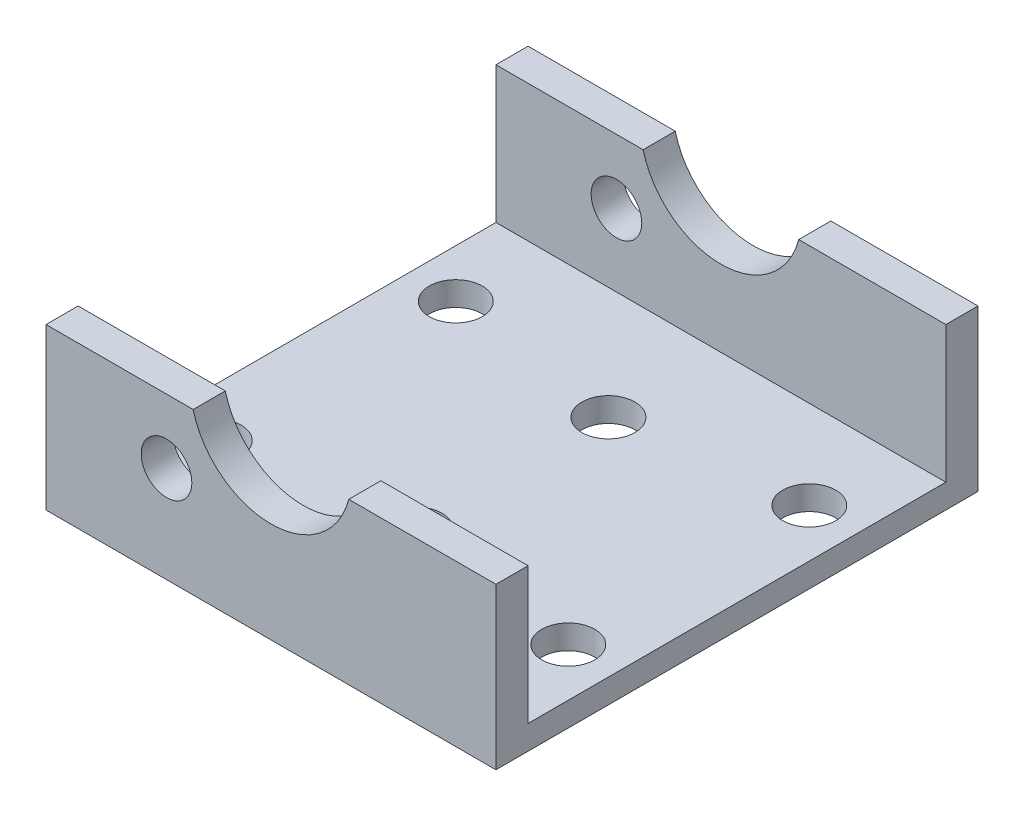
ISO-10303-21;
HEADER;
FILE_DESCRIPTION(('STEP AP214'),'2;1');
FILE_NAME('part.step','',(''),(''),'','','');
FILE_SCHEMA(('AUTOMOTIVE_DESIGN { 1 0 10303 214 1 1 1 1 }'));
ENDSEC;
DATA;
#1=APPLICATION_CONTEXT('core data for automotive mechanical design processes');
#2=APPLICATION_PROTOCOL_DEFINITION('international standard','automotive_design',2000,#1);
#3=PRODUCT_CONTEXT('',#1,'mechanical');
#4=PRODUCT('Part','Part','',(#3));
#5=PRODUCT_RELATED_PRODUCT_CATEGORY('part','',(#4));
#6=PRODUCT_DEFINITION_FORMATION('','',#4);
#7=PRODUCT_DEFINITION_CONTEXT('part definition',#1,'design');
#8=PRODUCT_DEFINITION('design','',#6,#7);
#9=PRODUCT_DEFINITION_SHAPE('','',#8);
#10=(LENGTH_UNIT() NAMED_UNIT(*) SI_UNIT(.MILLI.,.METRE.));
#11=(NAMED_UNIT(*) PLANE_ANGLE_UNIT() SI_UNIT($,.RADIAN.));
#12=(NAMED_UNIT(*) SI_UNIT($,.STERADIAN.) SOLID_ANGLE_UNIT());
#13=UNCERTAINTY_MEASURE_WITH_UNIT(LENGTH_MEASURE(1.E-05),#10,'distance_accuracy_value','');
#14=(GEOMETRIC_REPRESENTATION_CONTEXT(3) GLOBAL_UNCERTAINTY_ASSIGNED_CONTEXT((#13)) GLOBAL_UNIT_ASSIGNED_CONTEXT((#10,
#11,#12)) REPRESENTATION_CONTEXT('',''));
#15=CARTESIAN_POINT('',(0.,0.,0.));
#16=DIRECTION('',(0.,0.,1.));
#17=DIRECTION('',(1.,0.,0.));
#18=AXIS2_PLACEMENT_3D('',#15,#16,#17);
#19=CARTESIAN_POINT('',(-28.,35.,30.));
#20=DIRECTION('',(0.,-1.,0.));
#21=DIRECTION('',(0.,0.,-1.));
#22=AXIS2_PLACEMENT_3D('',#19,#20,#21);
#23=PLANE('',#22);
#24=DIRECTION('',(0.,0.,-1.));
#25=VECTOR('',#24,1.);
#26=CARTESIAN_POINT('',(28.,35.,30.));
#27=LINE('',#26,#25);
#28=CARTESIAN_POINT('',(28.,35.,30.));
#29=VERTEX_POINT('',#28);
#30=CARTESIAN_POINT('',(28.,35.,26.));
#31=VERTEX_POINT('',#30);
#32=EDGE_CURVE('E142',#29,#31,#27,.T.);
#33=ORIENTED_EDGE('',*,*,#32,.T.);
#34=DIRECTION('',(-1.,0.,0.));
#35=VECTOR('',#34,1.);
#36=CARTESIAN_POINT('',(28.,35.,26.));
#37=LINE('',#36,#35);
#38=CARTESIAN_POINT('',(9.68245836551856,35.,26.));
#39=VERTEX_POINT('',#38);
#40=EDGE_CURVE('E127',#31,#39,#37,.T.);
#41=ORIENTED_EDGE('',*,*,#40,.T.);
#42=DIRECTION('',(0.,0.,1.));
#43=VECTOR('',#42,1.);
#44=CARTESIAN_POINT('',(9.68245836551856,35.,-30.));
#45=LINE('',#44,#43);
#46=CARTESIAN_POINT('',(9.68245836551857,35.,30.));
#47=VERTEX_POINT('',#46);
#48=EDGE_CURVE('E195',#39,#47,#45,.T.);
#49=ORIENTED_EDGE('',*,*,#48,.T.);
#50=DIRECTION('',(-1.,0.,0.));
#51=VECTOR('',#50,1.);
#52=CARTESIAN_POINT('',(-28.,35.,30.));
#53=LINE('',#52,#51);
#54=EDGE_CURVE('E151',#29,#47,#53,.T.);
#55=ORIENTED_EDGE('',*,*,#54,.F.);
#56=EDGE_LOOP('',(#33,#41,#49,#55));
#57=FACE_BOUND('',#56,.T.);
#58=ADVANCED_FACE('F35',(#57),#23,.F.);
#59=DIRECTION('',(0.,0.,1.));
#60=VECTOR('',#59,1.);
#61=CARTESIAN_POINT('',(-9.68245836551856,35.,-30.));
#62=LINE('',#61,#60);
#63=CARTESIAN_POINT('',(-9.68245836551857,35.,30.));
#64=VERTEX_POINT('',#63);
#65=CARTESIAN_POINT('',(-9.68245836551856,35.,26.));
#66=VERTEX_POINT('',#65);
#67=EDGE_CURVE('E192',#64,#66,#62,.F.);
#68=ORIENTED_EDGE('',*,*,#67,.T.);
#69=CARTESIAN_POINT('',(-28.,35.,26.));
#70=VERTEX_POINT('',#69);
#71=EDGE_CURVE('E136',#66,#70,#37,.T.);
#72=ORIENTED_EDGE('',*,*,#71,.T.);
#73=DIRECTION('',(0.,0.,-1.));
#74=VECTOR('',#73,1.);
#75=CARTESIAN_POINT('',(-28.,35.,30.));
#76=LINE('',#75,#74);
#77=CARTESIAN_POINT('',(-28.,35.,30.));
#78=VERTEX_POINT('',#77);
#79=EDGE_CURVE('E158',#78,#70,#76,.T.);
#80=ORIENTED_EDGE('',*,*,#79,.F.);
#81=EDGE_CURVE('E218',#64,#78,#53,.T.);
#82=ORIENTED_EDGE('',*,*,#81,.F.);
#83=EDGE_LOOP('',(#68,#72,#80,#82));
#84=FACE_BOUND('',#83,.T.);
#85=ADVANCED_FACE('F256',(#84),#23,.F.);
#86=CARTESIAN_POINT('',(0.,37.5,-30.));
#87=DIRECTION('',(0.,0.,1.));
#88=DIRECTION('',(1.,0.,0.));
#89=AXIS2_PLACEMENT_3D('',#86,#87,#88);
#90=CYLINDRICAL_SURFACE('',#89,10.);
#91=ORIENTED_EDGE('',*,*,#48,.F.);
#92=CARTESIAN_POINT('',(0.,37.5,26.));
#93=DIRECTION('',(0.,0.,1.));
#94=DIRECTION('',(1.,0.,0.));
#95=AXIS2_PLACEMENT_3D('',#92,#93,#94);
#96=CIRCLE('',#95,10.);
#97=EDGE_CURVE('E11',#39,#66,#96,.F.);
#98=ORIENTED_EDGE('',*,*,#97,.T.);
#99=ORIENTED_EDGE('',*,*,#67,.F.);
#100=CARTESIAN_POINT('',(0.,37.5,30.));
#101=DIRECTION('',(0.,0.,1.));
#102=DIRECTION('',(1.,0.,0.));
#103=AXIS2_PLACEMENT_3D('',#100,#101,#102);
#104=CIRCLE('',#103,10.);
#105=EDGE_CURVE('E186',#64,#47,#104,.T.);
#106=ORIENTED_EDGE('',*,*,#105,.T.);
#107=EDGE_LOOP('',(#91,#98,#99,#106));
#108=FACE_BOUND('',#107,.T.);
#109=ADVANCED_FACE('F272',(#108),#90,.F.);
#110=CARTESIAN_POINT('',(9.68245836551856,35.,-30.));
#111=VERTEX_POINT('',#110);
#112=CARTESIAN_POINT('',(9.68245836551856,35.,-26.));
#113=VERTEX_POINT('',#112);
#114=EDGE_CURVE('E59',#111,#113,#45,.T.);
#115=ORIENTED_EDGE('',*,*,#114,.T.);
#116=DIRECTION('',(-1.,0.,0.));
#117=VECTOR('',#116,1.);
#118=CARTESIAN_POINT('',(28.,35.,-26.));
#119=LINE('',#118,#117);
#120=CARTESIAN_POINT('',(28.,35.,-26.));
#121=VERTEX_POINT('',#120);
#122=EDGE_CURVE('E52',#121,#113,#119,.T.);
#123=ORIENTED_EDGE('',*,*,#122,.F.);
#124=CARTESIAN_POINT('',(28.,35.,-30.));
#125=VERTEX_POINT('',#124);
#126=EDGE_CURVE('E153',#121,#125,#27,.T.);
#127=ORIENTED_EDGE('',*,*,#126,.T.);
#128=DIRECTION('',(-1.,0.,0.));
#129=VECTOR('',#128,1.);
#130=CARTESIAN_POINT('',(-28.,35.,-30.));
#131=LINE('',#130,#129);
#132=EDGE_CURVE('E214',#125,#111,#131,.T.);
#133=ORIENTED_EDGE('',*,*,#132,.T.);
#134=EDGE_LOOP('',(#115,#123,#127,#133));
#135=FACE_BOUND('',#134,.T.);
#136=ADVANCED_FACE('F266',(#135),#23,.F.);
#137=CARTESIAN_POINT('',(-28.,15.,30.));
#138=DIRECTION('',(1.,0.,0.));
#139=DIRECTION('',(0.,1.,0.));
#140=AXIS2_PLACEMENT_3D('',#137,#138,#139);
#141=PLANE('',#140);
#142=ORIENTED_EDGE('',*,*,#79,.T.);
#143=DIRECTION('',(0.,1.,0.));
#144=VECTOR('',#143,1.);
#145=CARTESIAN_POINT('',(-28.,35.,26.));
#146=LINE('',#145,#144);
#147=CARTESIAN_POINT('',(-28.,18.,26.));
#148=VERTEX_POINT('',#147);
#149=EDGE_CURVE('E252',#148,#70,#146,.T.);
#150=ORIENTED_EDGE('',*,*,#149,.F.);
#151=DIRECTION('',(0.,0.,1.));
#152=VECTOR('',#151,1.);
#153=CARTESIAN_POINT('',(-28.,18.,26.));
#154=LINE('',#153,#152);
#155=CARTESIAN_POINT('',(-28.,18.,-26.));
#156=VERTEX_POINT('',#155);
#157=EDGE_CURVE('E148',#156,#148,#154,.T.);
#158=ORIENTED_EDGE('',*,*,#157,.F.);
#159=DIRECTION('',(0.,-1.,0.));
#160=VECTOR('',#159,1.);
#161=CARTESIAN_POINT('',(-28.,35.,-26.));
#162=LINE('',#161,#160);
#163=CARTESIAN_POINT('',(-28.,35.,-26.));
#164=VERTEX_POINT('',#163);
#165=EDGE_CURVE('E249',#164,#156,#162,.T.);
#166=ORIENTED_EDGE('',*,*,#165,.F.);
#167=CARTESIAN_POINT('',(-28.,35.,-30.));
#168=VERTEX_POINT('',#167);
#169=EDGE_CURVE('E220',#164,#168,#76,.T.);
#170=ORIENTED_EDGE('',*,*,#169,.T.);
#171=DIRECTION('',(0.,-1.,0.));
#172=VECTOR('',#171,1.);
#173=CARTESIAN_POINT('',(-28.,15.,-30.));
#174=LINE('',#173,#172);
#175=CARTESIAN_POINT('',(-28.,15.,-30.));
#176=VERTEX_POINT('',#175);
#177=EDGE_CURVE('E209',#168,#176,#174,.T.);
#178=ORIENTED_EDGE('',*,*,#177,.T.);
#179=DIRECTION('',(0.,0.,-1.));
#180=VECTOR('',#179,1.);
#181=CARTESIAN_POINT('',(-28.,15.,30.));
#182=LINE('',#181,#180);
#183=CARTESIAN_POINT('',(-28.,15.,30.));
#184=VERTEX_POINT('',#183);
#185=EDGE_CURVE('E156',#184,#176,#182,.T.);
#186=ORIENTED_EDGE('',*,*,#185,.F.);
#187=DIRECTION('',(0.,-1.,0.));
#188=VECTOR('',#187,1.);
#189=CARTESIAN_POINT('',(-28.,15.,30.));
#190=LINE('',#189,#188);
#191=EDGE_CURVE('E210',#78,#184,#190,.T.);
#192=ORIENTED_EDGE('',*,*,#191,.F.);
#193=EDGE_LOOP('',(#142,#150,#158,#166,#170,#178,#186,#192));
#194=FACE_BOUND('',#193,.T.);
#195=ADVANCED_FACE('F37',(#194),#141,.F.);
#196=CARTESIAN_POINT('',(-28.,15.,30.));
#197=DIRECTION('',(0.,1.,0.));
#198=DIRECTION('',(0.,0.,1.));
#199=AXIS2_PLACEMENT_3D('',#196,#197,#198);
#200=PLANE('',#199);
#201=CARTESIAN_POINT('',(-1.41900380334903E-13,15.,12.));
#202=DIRECTION('',(0.,1.,0.));
#203=DIRECTION('',(0.,0.,1.));
#204=AXIS2_PLACEMENT_3D('',#201,#202,#203);
#205=CIRCLE('',#204,3.3);
#206=CARTESIAN_POINT('',(-1.41900380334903E-13,15.,15.3));
#207=VERTEX_POINT('',#206);
#208=EDGE_CURVE('E313',#207,#207,#205,.T.);
#209=ORIENTED_EDGE('',*,*,#208,.T.);
#210=EDGE_LOOP('',(#209));
#211=FACE_BOUND('',#210,.T.);
#212=CARTESIAN_POINT('',(-1.41900380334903E-13,15.,-12.));
#213=DIRECTION('',(0.,1.,0.));
#214=DIRECTION('',(0.,0.,1.));
#215=AXIS2_PLACEMENT_3D('',#212,#213,#214);
#216=CIRCLE('',#215,3.3);
#217=CARTESIAN_POINT('',(-1.41900380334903E-13,15.,-8.7));
#218=VERTEX_POINT('',#217);
#219=EDGE_CURVE('E260',#218,#218,#216,.T.);
#220=ORIENTED_EDGE('',*,*,#219,.T.);
#221=EDGE_LOOP('',(#220));
#222=FACE_BOUND('',#221,.T.);
#223=CARTESIAN_POINT('',(-22.0000000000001,15.,15.));
#224=DIRECTION('',(0.,1.,0.));
#225=DIRECTION('',(0.,0.,1.));
#226=AXIS2_PLACEMENT_3D('',#223,#224,#225);
#227=CIRCLE('',#226,3.3);
#228=CARTESIAN_POINT('',(-22.0000000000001,15.,18.3));
#229=VERTEX_POINT('',#228);
#230=EDGE_CURVE('E197',#229,#229,#227,.T.);
#231=ORIENTED_EDGE('',*,*,#230,.T.);
#232=EDGE_LOOP('',(#231));
#233=FACE_BOUND('',#232,.T.);
#234=CARTESIAN_POINT('',(-22.0000000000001,15.,-15.));
#235=DIRECTION('',(0.,1.,0.));
#236=DIRECTION('',(0.,0.,1.));
#237=AXIS2_PLACEMENT_3D('',#234,#235,#236);
#238=CIRCLE('',#237,3.3);
#239=CARTESIAN_POINT('',(-22.0000000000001,15.,-11.7));
#240=VERTEX_POINT('',#239);
#241=EDGE_CURVE('E200',#240,#240,#238,.T.);
#242=ORIENTED_EDGE('',*,*,#241,.T.);
#243=EDGE_LOOP('',(#242));
#244=FACE_BOUND('',#243,.T.);
#245=CARTESIAN_POINT('',(21.9999999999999,15.,-15.));
#246=DIRECTION('',(0.,1.,0.));
#247=DIRECTION('',(0.,0.,1.));
#248=AXIS2_PLACEMENT_3D('',#245,#246,#247);
#249=CIRCLE('',#248,3.3);
#250=CARTESIAN_POINT('',(21.9999999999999,15.,-11.7));
#251=VERTEX_POINT('',#250);
#252=EDGE_CURVE('E203',#251,#251,#249,.T.);
#253=ORIENTED_EDGE('',*,*,#252,.T.);
#254=EDGE_LOOP('',(#253));
#255=FACE_BOUND('',#254,.T.);
#256=CARTESIAN_POINT('',(21.9999999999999,15.,15.));
#257=DIRECTION('',(0.,1.,0.));
#258=DIRECTION('',(0.,0.,1.));
#259=AXIS2_PLACEMENT_3D('',#256,#257,#258);
#260=CIRCLE('',#259,3.3);
#261=CARTESIAN_POINT('',(21.9999999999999,15.,18.3));
#262=VERTEX_POINT('',#261);
#263=EDGE_CURVE('E206',#262,#262,#260,.T.);
#264=ORIENTED_EDGE('',*,*,#263,.T.);
#265=EDGE_LOOP('',(#264));
#266=FACE_BOUND('',#265,.T.);
#267=DIRECTION('',(1.,0.,0.));
#268=VECTOR('',#267,1.);
#269=CARTESIAN_POINT('',(-28.,15.,-30.));
#270=LINE('',#269,#268);
#271=CARTESIAN_POINT('',(28.,15.,-30.));
#272=VERTEX_POINT('',#271);
#273=EDGE_CURVE('E223',#176,#272,#270,.T.);
#274=ORIENTED_EDGE('',*,*,#273,.T.);
#275=DIRECTION('',(0.,0.,-1.));
#276=VECTOR('',#275,1.);
#277=CARTESIAN_POINT('',(28.,15.,30.));
#278=LINE('',#277,#276);
#279=CARTESIAN_POINT('',(28.,15.,30.));
#280=VERTEX_POINT('',#279);
#281=EDGE_CURVE('E152',#280,#272,#278,.T.);
#282=ORIENTED_EDGE('',*,*,#281,.F.);
#283=DIRECTION('',(1.,0.,0.));
#284=VECTOR('',#283,1.);
#285=CARTESIAN_POINT('',(-28.,15.,30.));
#286=LINE('',#285,#284);
#287=EDGE_CURVE('E213',#184,#280,#286,.T.);
#288=ORIENTED_EDGE('',*,*,#287,.F.);
#289=ORIENTED_EDGE('',*,*,#185,.T.);
#290=EDGE_LOOP('',(#274,#282,#288,#289));
#291=FACE_BOUND('',#290,.T.);
#292=ADVANCED_FACE('F299',(#211,#222,#233,#244,#255,#266,#291),#200,.F.);
#293=CARTESIAN_POINT('',(28.,15.,30.));
#294=DIRECTION('',(-1.,0.,0.));
#295=DIRECTION('',(0.,-1.,0.));
#296=AXIS2_PLACEMENT_3D('',#293,#294,#295);
#297=PLANE('',#296);
#298=DIRECTION('',(0.,0.,1.));
#299=VECTOR('',#298,1.);
#300=CARTESIAN_POINT('',(28.,18.,26.));
#301=LINE('',#300,#299);
#302=CARTESIAN_POINT('',(28.,18.,-26.));
#303=VERTEX_POINT('',#302);
#304=CARTESIAN_POINT('',(28.,18.,26.));
#305=VERTEX_POINT('',#304);
#306=EDGE_CURVE('E146',#303,#305,#301,.T.);
#307=ORIENTED_EDGE('',*,*,#306,.T.);
#308=DIRECTION('',(0.,1.,0.));
#309=VECTOR('',#308,1.);
#310=CARTESIAN_POINT('',(28.,35.,26.));
#311=LINE('',#310,#309);
#312=EDGE_CURVE('E130',#305,#31,#311,.T.);
#313=ORIENTED_EDGE('',*,*,#312,.T.);
#314=ORIENTED_EDGE('',*,*,#32,.F.);
#315=DIRECTION('',(0.,1.,0.));
#316=VECTOR('',#315,1.);
#317=CARTESIAN_POINT('',(28.,15.,30.));
#318=LINE('',#317,#316);
#319=EDGE_CURVE('E216',#280,#29,#318,.T.);
#320=ORIENTED_EDGE('',*,*,#319,.F.);
#321=ORIENTED_EDGE('',*,*,#281,.T.);
#322=DIRECTION('',(0.,1.,0.));
#323=VECTOR('',#322,1.);
#324=CARTESIAN_POINT('',(28.,15.,-30.));
#325=LINE('',#324,#323);
#326=EDGE_CURVE('E225',#272,#125,#325,.T.);
#327=ORIENTED_EDGE('',*,*,#326,.T.);
#328=ORIENTED_EDGE('',*,*,#126,.F.);
#329=DIRECTION('',(0.,-1.,0.));
#330=VECTOR('',#329,1.);
#331=CARTESIAN_POINT('',(28.,35.,-26.));
#332=LINE('',#331,#330);
#333=EDGE_CURVE('E147',#121,#303,#332,.T.);
#334=ORIENTED_EDGE('',*,*,#333,.T.);
#335=EDGE_LOOP('',(#307,#313,#314,#320,#321,#327,#328,#334));
#336=FACE_BOUND('',#335,.T.);
#337=ADVANCED_FACE('F140',(#336),#297,.F.);
#338=ORIENTED_EDGE('',*,*,#169,.F.);
#339=CARTESIAN_POINT('',(-9.68245836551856,35.,-26.));
#340=VERTEX_POINT('',#339);
#341=EDGE_CURVE('E135',#340,#164,#119,.T.);
#342=ORIENTED_EDGE('',*,*,#341,.F.);
#343=CARTESIAN_POINT('',(-9.68245836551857,35.,-30.));
#344=VERTEX_POINT('',#343);
#345=EDGE_CURVE('E189',#340,#344,#62,.F.);
#346=ORIENTED_EDGE('',*,*,#345,.T.);
#347=EDGE_CURVE('E227',#344,#168,#131,.T.);
#348=ORIENTED_EDGE('',*,*,#347,.T.);
#349=EDGE_LOOP('',(#338,#342,#346,#348));
#350=FACE_BOUND('',#349,.T.);
#351=ADVANCED_FACE('F236',(#350),#23,.F.);
#352=CARTESIAN_POINT('',(-28.,35.,30.));
#353=DIRECTION('',(0.,0.,-1.));
#354=DIRECTION('',(-1.,0.,0.));
#355=AXIS2_PLACEMENT_3D('',#352,#353,#354);
#356=PLANE('',#355);
#357=CARTESIAN_POINT('',(-13.,27.,30.));
#358=DIRECTION('',(0.,0.,1.));
#359=DIRECTION('',(1.,0.,0.));
#360=AXIS2_PLACEMENT_3D('',#357,#358,#359);
#361=CIRCLE('',#360,3.15000000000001);
#362=CARTESIAN_POINT('',(-9.84999999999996,27.,30.));
#363=VERTEX_POINT('',#362);
#364=EDGE_CURVE('E451',#363,#363,#361,.T.);
#365=ORIENTED_EDGE('',*,*,#364,.F.);
#366=EDGE_LOOP('',(#365));
#367=FACE_BOUND('',#366,.T.);
#368=ORIENTED_EDGE('',*,*,#54,.T.);
#369=ORIENTED_EDGE('',*,*,#105,.F.);
#370=ORIENTED_EDGE('',*,*,#81,.T.);
#371=ORIENTED_EDGE('',*,*,#191,.T.);
#372=ORIENTED_EDGE('',*,*,#287,.T.);
#373=ORIENTED_EDGE('',*,*,#319,.T.);
#374=EDGE_LOOP('',(#368,#369,#370,#371,#372,#373));
#375=FACE_BOUND('',#374,.T.);
#376=ADVANCED_FACE('F292',(#367,#375),#356,.F.);
#377=CARTESIAN_POINT('',(-28.,35.,-30.));
#378=DIRECTION('',(0.,0.,-1.));
#379=DIRECTION('',(-1.,0.,0.));
#380=AXIS2_PLACEMENT_3D('',#377,#378,#379);
#381=PLANE('',#380);
#382=CARTESIAN_POINT('',(-13.,27.,-30.));
#383=DIRECTION('',(0.,0.,1.));
#384=DIRECTION('',(1.,0.,0.));
#385=AXIS2_PLACEMENT_3D('',#382,#383,#384);
#386=CIRCLE('',#385,3.15000000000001);
#387=CARTESIAN_POINT('',(-9.84999999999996,27.,-30.));
#388=VERTEX_POINT('',#387);
#389=EDGE_CURVE('E460',#388,#388,#386,.T.);
#390=ORIENTED_EDGE('',*,*,#389,.T.);
#391=EDGE_LOOP('',(#390));
#392=FACE_BOUND('',#391,.T.);
#393=CARTESIAN_POINT('',(0.,37.5,-30.));
#394=DIRECTION('',(0.,0.,1.));
#395=DIRECTION('',(1.,0.,0.));
#396=AXIS2_PLACEMENT_3D('',#393,#394,#395);
#397=CIRCLE('',#396,10.);
#398=EDGE_CURVE('E187',#344,#111,#397,.T.);
#399=ORIENTED_EDGE('',*,*,#398,.T.);
#400=ORIENTED_EDGE('',*,*,#132,.F.);
#401=ORIENTED_EDGE('',*,*,#326,.F.);
#402=ORIENTED_EDGE('',*,*,#273,.F.);
#403=ORIENTED_EDGE('',*,*,#177,.F.);
#404=ORIENTED_EDGE('',*,*,#347,.F.);
#405=EDGE_LOOP('',(#399,#400,#401,#402,#403,#404));
#406=FACE_BOUND('',#405,.T.);
#407=ADVANCED_FACE('F240',(#392,#406),#381,.T.);
#408=CARTESIAN_POINT('',(21.9999999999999,35.,15.));
#409=DIRECTION('',(0.,1.,0.));
#410=DIRECTION('',(0.,0.,1.));
#411=AXIS2_PLACEMENT_3D('',#408,#409,#410);
#412=CYLINDRICAL_SURFACE('',#411,3.29999999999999);
#413=CARTESIAN_POINT('',(21.9999999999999,18.,15.));
#414=DIRECTION('',(0.,-1.,0.));
#415=DIRECTION('',(1.,0.,0.));
#416=AXIS2_PLACEMENT_3D('',#413,#414,#415);
#417=CIRCLE('',#416,3.29999999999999);
#418=CARTESIAN_POINT('',(25.2999999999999,18.,15.));
#419=VERTEX_POINT('',#418);
#420=EDGE_CURVE('E183',#419,#419,#417,.F.);
#421=ORIENTED_EDGE('',*,*,#420,.T.);
#422=EDGE_LOOP('',(#421));
#423=FACE_BOUND('',#422,.T.);
#424=ORIENTED_EDGE('',*,*,#263,.F.);
#425=EDGE_LOOP('',(#424));
#426=FACE_BOUND('',#425,.T.);
#427=ADVANCED_FACE('F328',(#423,#426),#412,.F.);
#428=CARTESIAN_POINT('',(21.9999999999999,35.,-15.));
#429=DIRECTION('',(0.,1.,0.));
#430=DIRECTION('',(0.,0.,1.));
#431=AXIS2_PLACEMENT_3D('',#428,#429,#430);
#432=CYLINDRICAL_SURFACE('',#431,3.29999999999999);
#433=CARTESIAN_POINT('',(21.9999999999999,18.,-15.));
#434=DIRECTION('',(0.,-1.,0.));
#435=DIRECTION('',(1.,0.,0.));
#436=AXIS2_PLACEMENT_3D('',#433,#434,#435);
#437=CIRCLE('',#436,3.29999999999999);
#438=CARTESIAN_POINT('',(25.2999999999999,18.,-15.));
#439=VERTEX_POINT('',#438);
#440=EDGE_CURVE('E171',#439,#439,#437,.F.);
#441=ORIENTED_EDGE('',*,*,#440,.T.);
#442=EDGE_LOOP('',(#441));
#443=FACE_BOUND('',#442,.T.);
#444=ORIENTED_EDGE('',*,*,#252,.F.);
#445=EDGE_LOOP('',(#444));
#446=FACE_BOUND('',#445,.T.);
#447=ADVANCED_FACE('F330',(#443,#446),#432,.F.);
#448=CARTESIAN_POINT('',(-22.0000000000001,35.,-15.));
#449=DIRECTION('',(0.,1.,0.));
#450=DIRECTION('',(0.,0.,1.));
#451=AXIS2_PLACEMENT_3D('',#448,#449,#450);
#452=CYLINDRICAL_SURFACE('',#451,3.29999999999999);
#453=CARTESIAN_POINT('',(-22.0000000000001,18.,-15.));
#454=DIRECTION('',(0.,-1.,0.));
#455=DIRECTION('',(1.,0.,0.));
#456=AXIS2_PLACEMENT_3D('',#453,#454,#455);
#457=CIRCLE('',#456,3.29999999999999);
#458=CARTESIAN_POINT('',(-18.7000000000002,18.,-15.));
#459=VERTEX_POINT('',#458);
#460=EDGE_CURVE('E166',#459,#459,#457,.F.);
#461=ORIENTED_EDGE('',*,*,#460,.T.);
#462=EDGE_LOOP('',(#461));
#463=FACE_BOUND('',#462,.T.);
#464=ORIENTED_EDGE('',*,*,#241,.F.);
#465=EDGE_LOOP('',(#464));
#466=FACE_BOUND('',#465,.T.);
#467=ADVANCED_FACE('F279',(#463,#466),#452,.F.);
#468=CARTESIAN_POINT('',(-22.0000000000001,35.,15.));
#469=DIRECTION('',(0.,1.,0.));
#470=DIRECTION('',(0.,0.,1.));
#471=AXIS2_PLACEMENT_3D('',#468,#469,#470);
#472=CYLINDRICAL_SURFACE('',#471,3.29999999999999);
#473=CARTESIAN_POINT('',(-22.0000000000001,18.,15.));
#474=DIRECTION('',(0.,-1.,0.));
#475=DIRECTION('',(1.,0.,0.));
#476=AXIS2_PLACEMENT_3D('',#473,#474,#475);
#477=CIRCLE('',#476,3.29999999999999);
#478=CARTESIAN_POINT('',(-18.7000000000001,18.,15.));
#479=VERTEX_POINT('',#478);
#480=EDGE_CURVE('E164',#479,#479,#477,.F.);
#481=ORIENTED_EDGE('',*,*,#480,.T.);
#482=EDGE_LOOP('',(#481));
#483=FACE_BOUND('',#482,.T.);
#484=ORIENTED_EDGE('',*,*,#230,.F.);
#485=EDGE_LOOP('',(#484));
#486=FACE_BOUND('',#485,.T.);
#487=ADVANCED_FACE('F270',(#483,#486),#472,.F.);
#488=ORIENTED_EDGE('',*,*,#345,.F.);
#489=CARTESIAN_POINT('',(0.,37.5,-26.));
#490=DIRECTION('',(0.,0.,-1.));
#491=DIRECTION('',(0.,1.,0.));
#492=AXIS2_PLACEMENT_3D('',#489,#490,#491);
#493=CIRCLE('',#492,10.);
#494=EDGE_CURVE('E44',#340,#113,#493,.F.);
#495=ORIENTED_EDGE('',*,*,#494,.T.);
#496=ORIENTED_EDGE('',*,*,#114,.F.);
#497=ORIENTED_EDGE('',*,*,#398,.F.);
#498=EDGE_LOOP('',(#488,#495,#496,#497));
#499=FACE_BOUND('',#498,.T.);
#500=ADVANCED_FACE('F268',(#499),#90,.F.);
#501=CARTESIAN_POINT('',(28.,18.,26.));
#502=DIRECTION('',(0.,-1.,0.));
#503=DIRECTION('',(1.,0.,0.));
#504=AXIS2_PLACEMENT_3D('',#501,#502,#503);
#505=PLANE('',#504);
#506=CARTESIAN_POINT('',(-1.41900380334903E-13,18.,12.));
#507=DIRECTION('',(0.,1.,0.));
#508=DIRECTION('',(0.,0.,1.));
#509=AXIS2_PLACEMENT_3D('',#506,#507,#508);
#510=CIRCLE('',#509,3.3);
#511=CARTESIAN_POINT('',(-1.41900380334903E-13,18.,15.3));
#512=VERTEX_POINT('',#511);
#513=EDGE_CURVE('E455',#512,#512,#510,.T.);
#514=ORIENTED_EDGE('',*,*,#513,.F.);
#515=EDGE_LOOP('',(#514));
#516=FACE_BOUND('',#515,.T.);
#517=CARTESIAN_POINT('',(-1.41900380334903E-13,18.,-12.));
#518=DIRECTION('',(0.,1.,0.));
#519=DIRECTION('',(0.,0.,1.));
#520=AXIS2_PLACEMENT_3D('',#517,#518,#519);
#521=CIRCLE('',#520,3.3);
#522=CARTESIAN_POINT('',(-1.41900380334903E-13,18.,-8.7));
#523=VERTEX_POINT('',#522);
#524=EDGE_CURVE('E465',#523,#523,#521,.T.);
#525=ORIENTED_EDGE('',*,*,#524,.F.);
#526=EDGE_LOOP('',(#525));
#527=FACE_BOUND('',#526,.T.);
#528=ORIENTED_EDGE('',*,*,#440,.F.);
#529=EDGE_LOOP('',(#528));
#530=FACE_BOUND('',#529,.T.);
#531=ORIENTED_EDGE('',*,*,#480,.F.);
#532=EDGE_LOOP('',(#531));
#533=FACE_BOUND('',#532,.T.);
#534=ORIENTED_EDGE('',*,*,#157,.T.);
#535=DIRECTION('',(-1.,0.,0.));
#536=VECTOR('',#535,1.);
#537=CARTESIAN_POINT('',(28.,18.,26.));
#538=LINE('',#537,#536);
#539=EDGE_CURVE('E167',#305,#148,#538,.T.);
#540=ORIENTED_EDGE('',*,*,#539,.F.);
#541=ORIENTED_EDGE('',*,*,#306,.F.);
#542=DIRECTION('',(-1.,0.,0.));
#543=VECTOR('',#542,1.);
#544=CARTESIAN_POINT('',(28.,18.,-26.));
#545=LINE('',#544,#543);
#546=EDGE_CURVE('E173',#303,#156,#545,.T.);
#547=ORIENTED_EDGE('',*,*,#546,.T.);
#548=EDGE_LOOP('',(#534,#540,#541,#547));
#549=FACE_BOUND('',#548,.T.);
#550=ORIENTED_EDGE('',*,*,#460,.F.);
#551=EDGE_LOOP('',(#550));
#552=FACE_BOUND('',#551,.T.);
#553=ORIENTED_EDGE('',*,*,#420,.F.);
#554=EDGE_LOOP('',(#553));
#555=FACE_BOUND('',#554,.T.);
#556=ADVANCED_FACE('F262',(#516,#527,#530,#533,#549,#552,#555),#505,.F.);
#557=CARTESIAN_POINT('',(28.,35.,26.));
#558=DIRECTION('',(0.,0.,1.));
#559=DIRECTION('',(1.,0.,0.));
#560=AXIS2_PLACEMENT_3D('',#557,#558,#559);
#561=PLANE('',#560);
#562=CARTESIAN_POINT('',(-13.,27.,26.));
#563=DIRECTION('',(0.,0.,1.));
#564=DIRECTION('',(1.,0.,0.));
#565=AXIS2_PLACEMENT_3D('',#562,#563,#564);
#566=CIRCLE('',#565,3.15000000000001);
#567=CARTESIAN_POINT('',(-9.84999999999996,27.,26.));
#568=VERTEX_POINT('',#567);
#569=EDGE_CURVE('E454',#568,#568,#566,.T.);
#570=ORIENTED_EDGE('',*,*,#569,.T.);
#571=EDGE_LOOP('',(#570));
#572=FACE_BOUND('',#571,.T.);
#573=ORIENTED_EDGE('',*,*,#40,.F.);
#574=ORIENTED_EDGE('',*,*,#312,.F.);
#575=ORIENTED_EDGE('',*,*,#539,.T.);
#576=ORIENTED_EDGE('',*,*,#149,.T.);
#577=ORIENTED_EDGE('',*,*,#71,.F.);
#578=ORIENTED_EDGE('',*,*,#97,.F.);
#579=EDGE_LOOP('',(#573,#574,#575,#576,#577,#578));
#580=FACE_BOUND('',#579,.T.);
#581=ADVANCED_FACE('F129',(#572,#580),#561,.F.);
#582=CARTESIAN_POINT('',(28.,35.,-26.));
#583=DIRECTION('',(0.,0.,-1.));
#584=DIRECTION('',(0.,1.,0.));
#585=AXIS2_PLACEMENT_3D('',#582,#583,#584);
#586=PLANE('',#585);
#587=CARTESIAN_POINT('',(-13.,27.,-26.));
#588=DIRECTION('',(0.,0.,-1.));
#589=DIRECTION('',(0.,1.,0.));
#590=AXIS2_PLACEMENT_3D('',#587,#588,#589);
#591=CIRCLE('',#590,3.15000000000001);
#592=CARTESIAN_POINT('',(-13.,30.15,-26.));
#593=VERTEX_POINT('',#592);
#594=EDGE_CURVE('E39',#593,#593,#591,.T.);
#595=ORIENTED_EDGE('',*,*,#594,.T.);
#596=EDGE_LOOP('',(#595));
#597=FACE_BOUND('',#596,.T.);
#598=ORIENTED_EDGE('',*,*,#341,.T.);
#599=ORIENTED_EDGE('',*,*,#165,.T.);
#600=ORIENTED_EDGE('',*,*,#546,.F.);
#601=ORIENTED_EDGE('',*,*,#333,.F.);
#602=ORIENTED_EDGE('',*,*,#122,.T.);
#603=ORIENTED_EDGE('',*,*,#494,.F.);
#604=EDGE_LOOP('',(#598,#599,#600,#601,#602,#603));
#605=FACE_BOUND('',#604,.T.);
#606=ADVANCED_FACE('F264',(#597,#605),#586,.F.);
#607=CARTESIAN_POINT('',(-1.41900380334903E-13,18.,-12.));
#608=DIRECTION('',(0.,1.,0.));
#609=DIRECTION('',(0.,0.,1.));
#610=AXIS2_PLACEMENT_3D('',#607,#608,#609);
#611=CYLINDRICAL_SURFACE('',#610,3.3);
#612=ORIENTED_EDGE('',*,*,#219,.F.);
#613=EDGE_LOOP('',(#612));
#614=FACE_BOUND('',#613,.T.);
#615=ORIENTED_EDGE('',*,*,#524,.T.);
#616=EDGE_LOOP('',(#615));
#617=FACE_BOUND('',#616,.T.);
#618=ADVANCED_FACE('F381',(#614,#617),#611,.F.);
#619=CARTESIAN_POINT('',(-1.41900380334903E-13,18.,12.));
#620=DIRECTION('',(0.,1.,0.));
#621=DIRECTION('',(0.,0.,1.));
#622=AXIS2_PLACEMENT_3D('',#619,#620,#621);
#623=CYLINDRICAL_SURFACE('',#622,3.3);
#624=ORIENTED_EDGE('',*,*,#208,.F.);
#625=EDGE_LOOP('',(#624));
#626=FACE_BOUND('',#625,.T.);
#627=ORIENTED_EDGE('',*,*,#513,.T.);
#628=EDGE_LOOP('',(#627));
#629=FACE_BOUND('',#628,.T.);
#630=ADVANCED_FACE('F386',(#626,#629),#623,.F.);
#631=CARTESIAN_POINT('',(-13.,27.,-30.));
#632=DIRECTION('',(0.,0.,1.));
#633=DIRECTION('',(1.,0.,0.));
#634=AXIS2_PLACEMENT_3D('',#631,#632,#633);
#635=CYLINDRICAL_SURFACE('',#634,3.15000000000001);
#636=ORIENTED_EDGE('',*,*,#389,.F.);
#637=EDGE_LOOP('',(#636));
#638=FACE_BOUND('',#637,.T.);
#639=ORIENTED_EDGE('',*,*,#594,.F.);
#640=EDGE_LOOP('',(#639));
#641=FACE_BOUND('',#640,.T.);
#642=ADVANCED_FACE('F398',(#638,#641),#635,.F.);
#643=ORIENTED_EDGE('',*,*,#364,.T.);
#644=EDGE_LOOP('',(#643));
#645=FACE_BOUND('',#644,.T.);
#646=ORIENTED_EDGE('',*,*,#569,.F.);
#647=EDGE_LOOP('',(#646));
#648=FACE_BOUND('',#647,.T.);
#649=ADVANCED_FACE('F435',(#645,#648),#635,.F.);
#650=CLOSED_SHELL('',(#58,#85,#109,#136,#195,#292,#337,#351,#376,#407,#427,#447,#467,#487,#500,
#556,#581,#606,#618,#630,#642,#649));
#651=MANIFOLD_SOLID_BREP('B2',#650);
#652=ADVANCED_BREP_SHAPE_REPRESENTATION('',(#18,#651),#14);
#653=SHAPE_DEFINITION_REPRESENTATION(#9,#652);
ENDSEC;
END-ISO-10303-21;
